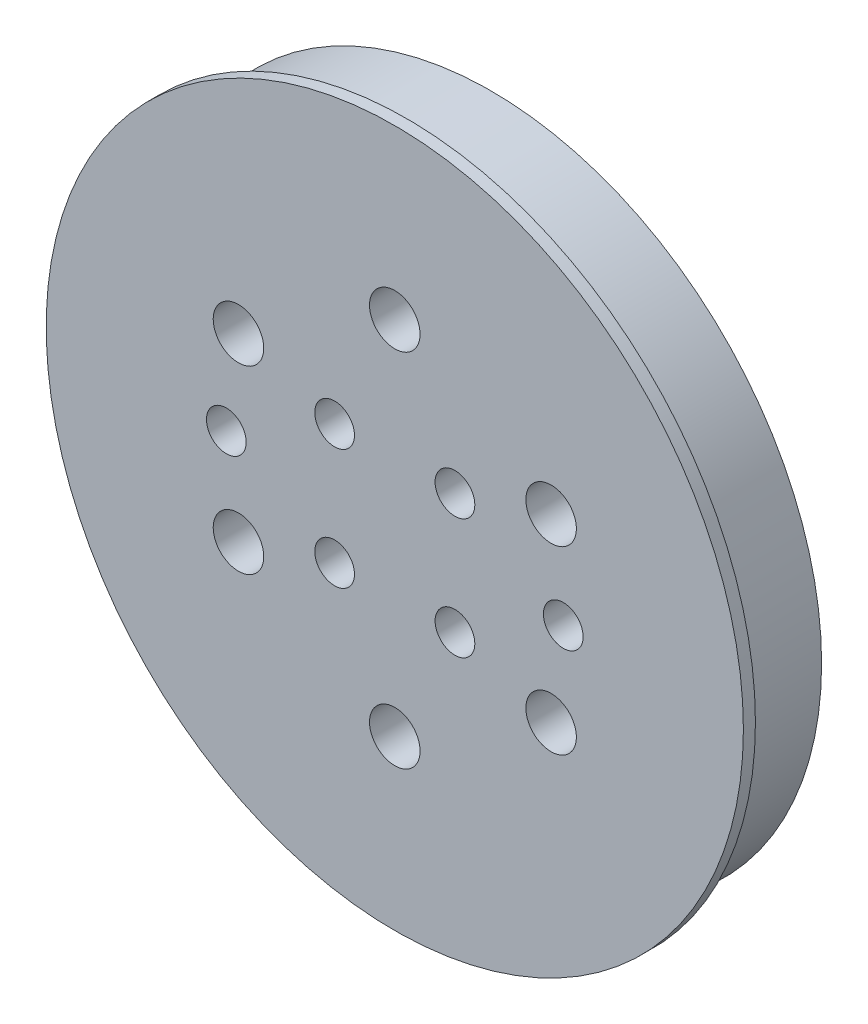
ISO-10303-21;
HEADER;
FILE_DESCRIPTION(('STEP AP214'),'2;1');
FILE_NAME('part.step','',(''),(''),'','','');
FILE_SCHEMA(('AUTOMOTIVE_DESIGN { 1 0 10303 214 1 1 1 1 }'));
ENDSEC;
DATA;
#1=APPLICATION_CONTEXT('core data for automotive mechanical design processes');
#2=APPLICATION_PROTOCOL_DEFINITION('international standard','automotive_design',2000,#1);
#3=PRODUCT_CONTEXT('',#1,'mechanical');
#4=PRODUCT('Part','Part','',(#3));
#5=PRODUCT_RELATED_PRODUCT_CATEGORY('part','',(#4));
#6=PRODUCT_DEFINITION_FORMATION('','',#4);
#7=PRODUCT_DEFINITION_CONTEXT('part definition',#1,'design');
#8=PRODUCT_DEFINITION('design','',#6,#7);
#9=PRODUCT_DEFINITION_SHAPE('','',#8);
#10=(LENGTH_UNIT() NAMED_UNIT(*) SI_UNIT(.MILLI.,.METRE.));
#11=(NAMED_UNIT(*) PLANE_ANGLE_UNIT() SI_UNIT($,.RADIAN.));
#12=(NAMED_UNIT(*) SI_UNIT($,.STERADIAN.) SOLID_ANGLE_UNIT());
#13=UNCERTAINTY_MEASURE_WITH_UNIT(LENGTH_MEASURE(1.E-05),#10,'distance_accuracy_value','');
#14=(GEOMETRIC_REPRESENTATION_CONTEXT(3) GLOBAL_UNCERTAINTY_ASSIGNED_CONTEXT((#13)) GLOBAL_UNIT_ASSIGNED_CONTEXT((#10,
#11,#12)) REPRESENTATION_CONTEXT('',''));
#15=CARTESIAN_POINT('',(0.,0.,0.));
#16=DIRECTION('',(0.,0.,1.));
#17=DIRECTION('',(1.,0.,0.));
#18=AXIS2_PLACEMENT_3D('',#15,#16,#17);
#19=CARTESIAN_POINT('',(-27.9424446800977,11.6577081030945,-3.));
#20=DIRECTION('',(0.,0.,-1.));
#21=DIRECTION('',(0.,-1.,0.));
#22=AXIS2_PLACEMENT_3D('',#19,#20,#21);
#23=PLANE('',#22);
#24=CARTESIAN_POINT('',(-14.9520636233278,4.15770810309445,-3.));
#25=DIRECTION('',(0.,0.,-1.));
#26=DIRECTION('',(-1.,0.,0.));
#27=AXIS2_PLACEMENT_3D('',#24,#25,#26);
#28=CIRCLE('',#27,3.5);
#29=CARTESIAN_POINT('',(-18.4520636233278,4.15770810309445,-3.));
#30=VERTEX_POINT('',#29);
#31=EDGE_CURVE('E42',#30,#30,#28,.T.);
#32=ORIENTED_EDGE('',*,*,#31,.F.);
#33=EDGE_LOOP('',(#32));
#34=FACE_BOUND('',#33,.T.);
#35=CARTESIAN_POINT('',(-22.9424446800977,16.6577081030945,-3.));
#36=DIRECTION('',(0.,0.,-1.));
#37=DIRECTION('',(-1.,0.,0.));
#38=AXIS2_PLACEMENT_3D('',#35,#36,#37);
#39=CIRCLE('',#38,1.65);
#40=CARTESIAN_POINT('',(-24.5924446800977,16.6577081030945,-3.));
#41=VERTEX_POINT('',#40);
#42=EDGE_CURVE('E154',#41,#41,#39,.T.);
#43=ORIENTED_EDGE('',*,*,#42,.F.);
#44=EDGE_LOOP('',(#43));
#45=FACE_BOUND('',#44,.T.);
#46=CARTESIAN_POINT('',(-22.9424446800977,6.65770810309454,-3.));
#47=DIRECTION('',(0.,0.,-1.));
#48=DIRECTION('',(-1.,0.,0.));
#49=AXIS2_PLACEMENT_3D('',#46,#47,#48);
#50=CIRCLE('',#49,1.65);
#51=CARTESIAN_POINT('',(-24.5924446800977,6.65770810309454,-3.));
#52=VERTEX_POINT('',#51);
#53=EDGE_CURVE('E148',#52,#52,#50,.T.);
#54=ORIENTED_EDGE('',*,*,#53,.F.);
#55=EDGE_LOOP('',(#54));
#56=FACE_BOUND('',#55,.T.);
#57=CARTESIAN_POINT('',(-32.9424446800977,16.6577081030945,-3.));
#58=DIRECTION('',(0.,0.,-1.));
#59=DIRECTION('',(-1.,0.,0.));
#60=AXIS2_PLACEMENT_3D('',#57,#58,#59);
#61=CIRCLE('',#60,1.65);
#62=CARTESIAN_POINT('',(-34.5924446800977,16.6577081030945,-3.));
#63=VERTEX_POINT('',#62);
#64=EDGE_CURVE('E128',#63,#63,#61,.T.);
#65=ORIENTED_EDGE('',*,*,#64,.F.);
#66=EDGE_LOOP('',(#65));
#67=FACE_BOUND('',#66,.T.);
#68=CARTESIAN_POINT('',(-40.9328257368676,19.1577081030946,-3.));
#69=DIRECTION('',(0.,0.,-1.));
#70=DIRECTION('',(-1.,0.,0.));
#71=AXIS2_PLACEMENT_3D('',#68,#69,#70);
#72=CIRCLE('',#71,3.5);
#73=CARTESIAN_POINT('',(-44.4328257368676,19.1577081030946,-3.));
#74=VERTEX_POINT('',#73);
#75=EDGE_CURVE('E114',#74,#74,#72,.T.);
#76=ORIENTED_EDGE('',*,*,#75,.F.);
#77=EDGE_LOOP('',(#76));
#78=FACE_BOUND('',#77,.T.);
#79=CARTESIAN_POINT('',(-27.9424446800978,-3.34229189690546,-3.));
#80=DIRECTION('',(0.,0.,-1.));
#81=DIRECTION('',(-1.,0.,0.));
#82=AXIS2_PLACEMENT_3D('',#79,#80,#81);
#83=CIRCLE('',#82,3.5);
#84=CARTESIAN_POINT('',(-31.4424446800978,-3.34229189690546,-3.));
#85=VERTEX_POINT('',#84);
#86=EDGE_CURVE('E101',#85,#85,#83,.T.);
#87=ORIENTED_EDGE('',*,*,#86,.F.);
#88=EDGE_LOOP('',(#87));
#89=FACE_BOUND('',#88,.T.);
#90=CARTESIAN_POINT('',(-40.9328257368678,4.15770810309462,-3.));
#91=DIRECTION('',(0.,0.,-1.));
#92=DIRECTION('',(-1.,0.,0.));
#93=AXIS2_PLACEMENT_3D('',#90,#91,#92);
#94=CIRCLE('',#93,3.5);
#95=CARTESIAN_POINT('',(-44.4328257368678,4.15770810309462,-3.));
#96=VERTEX_POINT('',#95);
#97=EDGE_CURVE('E102',#96,#96,#94,.T.);
#98=ORIENTED_EDGE('',*,*,#97,.F.);
#99=EDGE_LOOP('',(#98));
#100=FACE_BOUND('',#99,.T.);
#101=CARTESIAN_POINT('',(-14.9520636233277,19.1577081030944,-3.));
#102=DIRECTION('',(0.,0.,-1.));
#103=DIRECTION('',(-1.,0.,0.));
#104=AXIS2_PLACEMENT_3D('',#101,#102,#103);
#105=CIRCLE('',#104,3.5);
#106=CARTESIAN_POINT('',(-18.4520636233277,19.1577081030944,-3.));
#107=VERTEX_POINT('',#106);
#108=EDGE_CURVE('E50',#107,#107,#105,.T.);
#109=ORIENTED_EDGE('',*,*,#108,.F.);
#110=EDGE_LOOP('',(#109));
#111=FACE_BOUND('',#110,.T.);
#112=CARTESIAN_POINT('',(-27.9424446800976,26.6577081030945,-3.));
#113=DIRECTION('',(0.,0.,-1.));
#114=DIRECTION('',(-1.,0.,0.));
#115=AXIS2_PLACEMENT_3D('',#112,#113,#114);
#116=CIRCLE('',#115,3.5);
#117=CARTESIAN_POINT('',(-31.4424446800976,26.6577081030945,-3.));
#118=VERTEX_POINT('',#117);
#119=EDGE_CURVE('E59',#118,#118,#116,.T.);
#120=ORIENTED_EDGE('',*,*,#119,.F.);
#121=EDGE_LOOP('',(#120));
#122=FACE_BOUND('',#121,.T.);
#123=CARTESIAN_POINT('',(-32.9424446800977,6.65770810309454,-3.));
#124=DIRECTION('',(0.,0.,-1.));
#125=DIRECTION('',(-1.,0.,0.));
#126=AXIS2_PLACEMENT_3D('',#123,#124,#125);
#127=CIRCLE('',#126,1.65);
#128=CARTESIAN_POINT('',(-34.5924446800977,6.65770810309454,-3.));
#129=VERTEX_POINT('',#128);
#130=EDGE_CURVE('E139',#129,#129,#127,.T.);
#131=ORIENTED_EDGE('',*,*,#130,.F.);
#132=EDGE_LOOP('',(#131));
#133=FACE_BOUND('',#132,.T.);
#134=CARTESIAN_POINT('',(-41.9424446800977,11.6577081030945,-3.));
#135=DIRECTION('',(0.,0.,-1.));
#136=DIRECTION('',(-1.,0.,0.));
#137=AXIS2_PLACEMENT_3D('',#134,#135,#136);
#138=CIRCLE('',#137,1.65);
#139=CARTESIAN_POINT('',(-43.5924446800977,11.6577081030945,-3.));
#140=VERTEX_POINT('',#139);
#141=EDGE_CURVE('E149',#140,#140,#138,.T.);
#142=ORIENTED_EDGE('',*,*,#141,.F.);
#143=EDGE_LOOP('',(#142));
#144=FACE_BOUND('',#143,.T.);
#145=CARTESIAN_POINT('',(-13.9424446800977,11.6577081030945,-3.));
#146=DIRECTION('',(0.,0.,-1.));
#147=DIRECTION('',(-1.,0.,0.));
#148=AXIS2_PLACEMENT_3D('',#145,#146,#147);
#149=CIRCLE('',#148,1.65);
#150=CARTESIAN_POINT('',(-15.5924446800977,11.6577081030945,-3.));
#151=VERTEX_POINT('',#150);
#152=EDGE_CURVE('E10',#151,#151,#149,.T.);
#153=ORIENTED_EDGE('',*,*,#152,.F.);
#154=EDGE_LOOP('',(#153));
#155=FACE_BOUND('',#154,.T.);
#156=CARTESIAN_POINT('',(-27.9424446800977,11.6577081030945,-3.));
#157=DIRECTION('',(0.,0.,-1.));
#158=DIRECTION('',(-1.,0.,0.));
#159=AXIS2_PLACEMENT_3D('',#156,#157,#158);
#160=CIRCLE('',#159,21.);
#161=CARTESIAN_POINT('',(-48.9424446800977,11.6577081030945,-3.));
#162=VERTEX_POINT('',#161);
#163=EDGE_CURVE('E244',#162,#162,#160,.T.);
#164=ORIENTED_EDGE('',*,*,#163,.T.);
#165=EDGE_LOOP('',(#164));
#166=FACE_BOUND('',#165,.T.);
#167=ADVANCED_FACE('F15',(#34,#45,#56,#67,#78,#89,#100,#111,#122,#133,#144,#155,#166),#23,.T.);
#168=CARTESIAN_POINT('',(-27.9424446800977,36.1577081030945,4.));
#169=DIRECTION('',(0.,0.,-1.));
#170=DIRECTION('',(0.,-1.,0.));
#171=AXIS2_PLACEMENT_3D('',#168,#169,#170);
#172=PLANE('',#171);
#173=CARTESIAN_POINT('',(-27.9424446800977,36.1577081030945,4.));
#174=DIRECTION('',(0.,0.,-1.));
#175=DIRECTION('',(-1.,0.,0.));
#176=AXIS2_PLACEMENT_3D('',#173,#174,#175);
#177=CIRCLE('',#176,1.25);
#178=CARTESIAN_POINT('',(-29.1924446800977,36.1577081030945,4.));
#179=VERTEX_POINT('',#178);
#180=EDGE_CURVE('E221',#179,#179,#177,.T.);
#181=ORIENTED_EDGE('',*,*,#180,.T.);
#182=EDGE_LOOP('',(#181));
#183=FACE_BOUND('',#182,.T.);
#184=ADVANCED_FACE('F297',(#183),#172,.T.);
#185=CARTESIAN_POINT('',(-45.2665608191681,28.9818242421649,4.));
#186=DIRECTION('',(0.,0.,-1.));
#187=DIRECTION('',(0.,-1.,0.));
#188=AXIS2_PLACEMENT_3D('',#185,#186,#187);
#189=PLANE('',#188);
#190=CARTESIAN_POINT('',(-45.2665608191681,28.9818242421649,4.));
#191=DIRECTION('',(0.,0.,-1.));
#192=DIRECTION('',(-1.,0.,0.));
#193=AXIS2_PLACEMENT_3D('',#190,#191,#192);
#194=CIRCLE('',#193,1.25);
#195=CARTESIAN_POINT('',(-46.5165608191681,28.9818242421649,4.));
#196=VERTEX_POINT('',#195);
#197=EDGE_CURVE('E216',#196,#196,#194,.T.);
#198=ORIENTED_EDGE('',*,*,#197,.T.);
#199=EDGE_LOOP('',(#198));
#200=FACE_BOUND('',#199,.T.);
#201=ADVANCED_FACE('F302',(#200),#189,.T.);
#202=CARTESIAN_POINT('',(-52.4424446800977,11.6577081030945,4.));
#203=DIRECTION('',(0.,0.,-1.));
#204=DIRECTION('',(0.,-1.,0.));
#205=AXIS2_PLACEMENT_3D('',#202,#203,#204);
#206=PLANE('',#205);
#207=CARTESIAN_POINT('',(-52.4424446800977,11.6577081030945,4.));
#208=DIRECTION('',(0.,0.,-1.));
#209=DIRECTION('',(-1.,0.,0.));
#210=AXIS2_PLACEMENT_3D('',#207,#208,#209);
#211=CIRCLE('',#210,1.25);
#212=CARTESIAN_POINT('',(-53.6924446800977,11.6577081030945,4.));
#213=VERTEX_POINT('',#212);
#214=EDGE_CURVE('E215',#213,#213,#211,.T.);
#215=ORIENTED_EDGE('',*,*,#214,.T.);
#216=EDGE_LOOP('',(#215));
#217=FACE_BOUND('',#216,.T.);
#218=ADVANCED_FACE('F361',(#217),#206,.T.);
#219=CARTESIAN_POINT('',(-45.2665608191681,-5.66640803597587,4.));
#220=DIRECTION('',(0.,0.,-1.));
#221=DIRECTION('',(0.,-1.,0.));
#222=AXIS2_PLACEMENT_3D('',#219,#220,#221);
#223=PLANE('',#222);
#224=CARTESIAN_POINT('',(-45.2665608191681,-5.66640803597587,4.));
#225=DIRECTION('',(0.,0.,-1.));
#226=DIRECTION('',(-1.,0.,0.));
#227=AXIS2_PLACEMENT_3D('',#224,#225,#226);
#228=CIRCLE('',#227,1.25);
#229=CARTESIAN_POINT('',(-46.5165608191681,-5.66640803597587,4.));
#230=VERTEX_POINT('',#229);
#231=EDGE_CURVE('E206',#230,#230,#228,.T.);
#232=ORIENTED_EDGE('',*,*,#231,.T.);
#233=EDGE_LOOP('',(#232));
#234=FACE_BOUND('',#233,.T.);
#235=ADVANCED_FACE('F364',(#234),#223,.T.);
#236=CARTESIAN_POINT('',(-27.9424446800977,-12.8422918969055,4.));
#237=DIRECTION('',(0.,0.,-1.));
#238=DIRECTION('',(0.,-1.,0.));
#239=AXIS2_PLACEMENT_3D('',#236,#237,#238);
#240=PLANE('',#239);
#241=CARTESIAN_POINT('',(-27.9424446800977,-12.8422918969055,4.));
#242=DIRECTION('',(0.,0.,-1.));
#243=DIRECTION('',(-1.,0.,0.));
#244=AXIS2_PLACEMENT_3D('',#241,#242,#243);
#245=CIRCLE('',#244,1.25);
#246=CARTESIAN_POINT('',(-29.1924446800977,-12.8422918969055,4.));
#247=VERTEX_POINT('',#246);
#248=EDGE_CURVE('E194',#247,#247,#245,.T.);
#249=ORIENTED_EDGE('',*,*,#248,.T.);
#250=EDGE_LOOP('',(#249));
#251=FACE_BOUND('',#250,.T.);
#252=ADVANCED_FACE('F475',(#251),#240,.T.);
#253=CARTESIAN_POINT('',(-10.6183285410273,-5.66640803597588,4.));
#254=DIRECTION('',(0.,0.,-1.));
#255=DIRECTION('',(0.,-1.,0.));
#256=AXIS2_PLACEMENT_3D('',#253,#254,#255);
#257=PLANE('',#256);
#258=CARTESIAN_POINT('',(-10.6183285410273,-5.66640803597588,4.));
#259=DIRECTION('',(0.,0.,-1.));
#260=DIRECTION('',(-1.,0.,0.));
#261=AXIS2_PLACEMENT_3D('',#258,#259,#260);
#262=CIRCLE('',#261,1.25);
#263=CARTESIAN_POINT('',(-11.8683285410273,-5.66640803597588,4.));
#264=VERTEX_POINT('',#263);
#265=EDGE_CURVE('E183',#264,#264,#262,.T.);
#266=ORIENTED_EDGE('',*,*,#265,.T.);
#267=EDGE_LOOP('',(#266));
#268=FACE_BOUND('',#267,.T.);
#269=ADVANCED_FACE('F477',(#268),#257,.T.);
#270=CARTESIAN_POINT('',(-3.44244468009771,11.6577081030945,4.));
#271=DIRECTION('',(0.,0.,-1.));
#272=DIRECTION('',(0.,-1.,0.));
#273=AXIS2_PLACEMENT_3D('',#270,#271,#272);
#274=PLANE('',#273);
#275=CARTESIAN_POINT('',(-3.44244468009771,11.6577081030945,4.));
#276=DIRECTION('',(0.,0.,-1.));
#277=DIRECTION('',(-1.,0.,0.));
#278=AXIS2_PLACEMENT_3D('',#275,#276,#277);
#279=CIRCLE('',#278,1.25);
#280=CARTESIAN_POINT('',(-4.69244468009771,11.6577081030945,4.));
#281=VERTEX_POINT('',#280);
#282=EDGE_CURVE('E178',#281,#281,#279,.T.);
#283=ORIENTED_EDGE('',*,*,#282,.T.);
#284=EDGE_LOOP('',(#283));
#285=FACE_BOUND('',#284,.T.);
#286=ADVANCED_FACE('F292',(#285),#274,.T.);
#287=CARTESIAN_POINT('',(-10.6183285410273,28.9818242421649,4.));
#288=DIRECTION('',(0.,0.,-1.));
#289=DIRECTION('',(0.,-1.,0.));
#290=AXIS2_PLACEMENT_3D('',#287,#288,#289);
#291=PLANE('',#290);
#292=CARTESIAN_POINT('',(-10.6183285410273,28.9818242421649,4.));
#293=DIRECTION('',(0.,0.,-1.));
#294=DIRECTION('',(-1.,0.,0.));
#295=AXIS2_PLACEMENT_3D('',#292,#293,#294);
#296=CIRCLE('',#295,1.25);
#297=CARTESIAN_POINT('',(-11.8683285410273,28.9818242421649,4.));
#298=VERTEX_POINT('',#297);
#299=EDGE_CURVE('E169',#298,#298,#296,.T.);
#300=ORIENTED_EDGE('',*,*,#299,.T.);
#301=EDGE_LOOP('',(#300));
#302=FACE_BOUND('',#301,.T.);
#303=ADVANCED_FACE('F282',(#302),#291,.T.);
#304=CARTESIAN_POINT('',(-27.9424446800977,11.6577081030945,7.));
#305=DIRECTION('',(0.,0.,1.));
#306=DIRECTION('',(1.,0.,0.));
#307=AXIS2_PLACEMENT_3D('',#304,#305,#306);
#308=PLANE('',#307);
#309=CARTESIAN_POINT('',(-27.9424446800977,11.6577081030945,7.));
#310=DIRECTION('',(0.,0.,1.));
#311=DIRECTION('',(1.,0.,0.));
#312=AXIS2_PLACEMENT_3D('',#309,#310,#311);
#313=CIRCLE('',#312,27.47);
#314=CARTESIAN_POINT('',(-0.472444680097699,11.6577081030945,7.));
#315=VERTEX_POINT('',#314);
#316=EDGE_CURVE('E31',#315,#315,#313,.T.);
#317=ORIENTED_EDGE('',*,*,#316,.T.);
#318=EDGE_LOOP('',(#317));
#319=FACE_BOUND('',#318,.T.);
#320=CARTESIAN_POINT('',(-27.9424446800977,11.6577081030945,7.));
#321=DIRECTION('',(0.,0.,1.));
#322=DIRECTION('',(1.,0.,0.));
#323=AXIS2_PLACEMENT_3D('',#320,#321,#322);
#324=CIRCLE('',#323,28.97);
#325=CARTESIAN_POINT('',(1.0275553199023,11.6577081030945,7.));
#326=VERTEX_POINT('',#325);
#327=EDGE_CURVE('E202',#326,#326,#324,.T.);
#328=ORIENTED_EDGE('',*,*,#327,.F.);
#329=EDGE_LOOP('',(#328));
#330=FACE_BOUND('',#329,.T.);
#331=ADVANCED_FACE('F279',(#319,#330),#308,.F.);
#332=CARTESIAN_POINT('',(-40.9328257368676,19.1577081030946,2.));
#333=DIRECTION('',(0.,0.,-1.));
#334=DIRECTION('',(0.,-1.,0.));
#335=AXIS2_PLACEMENT_3D('',#332,#333,#334);
#336=PLANE('',#335);
#337=CARTESIAN_POINT('',(-40.9328257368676,19.1577081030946,2.));
#338=DIRECTION('',(0.,0.,1.));
#339=DIRECTION('',(-1.,0.,0.));
#340=AXIS2_PLACEMENT_3D('',#337,#338,#339);
#341=CIRCLE('',#340,2.1);
#342=CARTESIAN_POINT('',(-43.0328257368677,19.1577081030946,2.));
#343=VERTEX_POINT('',#342);
#344=EDGE_CURVE('E82',#343,#343,#341,.T.);
#345=ORIENTED_EDGE('',*,*,#344,.T.);
#346=EDGE_LOOP('',(#345));
#347=FACE_BOUND('',#346,.T.);
#348=CARTESIAN_POINT('',(-40.9328257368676,19.1577081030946,2.));
#349=DIRECTION('',(0.,0.,-1.));
#350=DIRECTION('',(-1.,0.,0.));
#351=AXIS2_PLACEMENT_3D('',#348,#349,#350);
#352=CIRCLE('',#351,3.5);
#353=CARTESIAN_POINT('',(-44.4328257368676,19.1577081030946,2.));
#354=VERTEX_POINT('',#353);
#355=EDGE_CURVE('E118',#354,#354,#352,.T.);
#356=ORIENTED_EDGE('',*,*,#355,.T.);
#357=EDGE_LOOP('',(#356));
#358=FACE_BOUND('',#357,.T.);
#359=ADVANCED_FACE('F281',(#347,#358),#336,.T.);
#360=CARTESIAN_POINT('',(-40.9328257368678,4.15770810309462,2.));
#361=DIRECTION('',(0.,0.,-1.));
#362=DIRECTION('',(0.,-1.,0.));
#363=AXIS2_PLACEMENT_3D('',#360,#361,#362);
#364=PLANE('',#363);
#365=CARTESIAN_POINT('',(-40.9328257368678,4.15770810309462,2.));
#366=DIRECTION('',(0.,0.,1.));
#367=DIRECTION('',(-1.,0.,0.));
#368=AXIS2_PLACEMENT_3D('',#365,#366,#367);
#369=CIRCLE('',#368,2.1);
#370=CARTESIAN_POINT('',(-43.0328257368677,4.15770810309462,2.));
#371=VERTEX_POINT('',#370);
#372=EDGE_CURVE('E83',#371,#371,#369,.T.);
#373=ORIENTED_EDGE('',*,*,#372,.T.);
#374=EDGE_LOOP('',(#373));
#375=FACE_BOUND('',#374,.T.);
#376=CARTESIAN_POINT('',(-40.9328257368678,4.15770810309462,2.));
#377=DIRECTION('',(0.,0.,-1.));
#378=DIRECTION('',(-1.,0.,0.));
#379=AXIS2_PLACEMENT_3D('',#376,#377,#378);
#380=CIRCLE('',#379,3.5);
#381=CARTESIAN_POINT('',(-44.4328257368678,4.15770810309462,2.));
#382=VERTEX_POINT('',#381);
#383=EDGE_CURVE('E110',#382,#382,#380,.T.);
#384=ORIENTED_EDGE('',*,*,#383,.T.);
#385=EDGE_LOOP('',(#384));
#386=FACE_BOUND('',#385,.T.);
#387=ADVANCED_FACE('F290',(#375,#386),#364,.T.);
#388=CARTESIAN_POINT('',(-27.9424446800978,-3.34229189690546,2.));
#389=DIRECTION('',(0.,0.,-1.));
#390=DIRECTION('',(0.,-1.,0.));
#391=AXIS2_PLACEMENT_3D('',#388,#389,#390);
#392=PLANE('',#391);
#393=CARTESIAN_POINT('',(-27.9424446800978,-3.34229189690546,2.));
#394=DIRECTION('',(0.,0.,1.));
#395=DIRECTION('',(-1.,0.,0.));
#396=AXIS2_PLACEMENT_3D('',#393,#394,#395);
#397=CIRCLE('',#396,2.1);
#398=CARTESIAN_POINT('',(-30.0424446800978,-3.34229189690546,2.));
#399=VERTEX_POINT('',#398);
#400=EDGE_CURVE('E73',#399,#399,#397,.T.);
#401=ORIENTED_EDGE('',*,*,#400,.T.);
#402=EDGE_LOOP('',(#401));
#403=FACE_BOUND('',#402,.T.);
#404=CARTESIAN_POINT('',(-27.9424446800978,-3.34229189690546,2.));
#405=DIRECTION('',(0.,0.,-1.));
#406=DIRECTION('',(-1.,0.,0.));
#407=AXIS2_PLACEMENT_3D('',#404,#405,#406);
#408=CIRCLE('',#407,3.5);
#409=CARTESIAN_POINT('',(-31.4424446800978,-3.34229189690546,2.));
#410=VERTEX_POINT('',#409);
#411=EDGE_CURVE('E97',#410,#410,#408,.T.);
#412=ORIENTED_EDGE('',*,*,#411,.T.);
#413=EDGE_LOOP('',(#412));
#414=FACE_BOUND('',#413,.T.);
#415=ADVANCED_FACE('F429',(#403,#414),#392,.T.);
#416=CARTESIAN_POINT('',(-14.9520636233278,4.15770810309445,2.));
#417=DIRECTION('',(0.,0.,-1.));
#418=DIRECTION('',(0.,-1.,0.));
#419=AXIS2_PLACEMENT_3D('',#416,#417,#418);
#420=PLANE('',#419);
#421=CARTESIAN_POINT('',(-14.9520636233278,4.15770810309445,2.));
#422=DIRECTION('',(0.,0.,1.));
#423=DIRECTION('',(-1.,0.,0.));
#424=AXIS2_PLACEMENT_3D('',#421,#422,#423);
#425=CIRCLE('',#424,2.1);
#426=CARTESIAN_POINT('',(-17.0520636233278,4.15770810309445,2.));
#427=VERTEX_POINT('',#426);
#428=EDGE_CURVE('E68',#427,#427,#425,.T.);
#429=ORIENTED_EDGE('',*,*,#428,.T.);
#430=EDGE_LOOP('',(#429));
#431=FACE_BOUND('',#430,.T.);
#432=CARTESIAN_POINT('',(-14.9520636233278,4.15770810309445,2.));
#433=DIRECTION('',(0.,0.,-1.));
#434=DIRECTION('',(-1.,0.,0.));
#435=AXIS2_PLACEMENT_3D('',#432,#433,#434);
#436=CIRCLE('',#435,3.5);
#437=CARTESIAN_POINT('',(-18.4520636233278,4.15770810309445,2.));
#438=VERTEX_POINT('',#437);
#439=EDGE_CURVE('E103',#438,#438,#436,.T.);
#440=ORIENTED_EDGE('',*,*,#439,.T.);
#441=EDGE_LOOP('',(#440));
#442=FACE_BOUND('',#441,.T.);
#443=ADVANCED_FACE('F467',(#431,#442),#420,.T.);
#444=CARTESIAN_POINT('',(-14.9520636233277,19.1577081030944,2.));
#445=DIRECTION('',(0.,0.,-1.));
#446=DIRECTION('',(0.,-1.,0.));
#447=AXIS2_PLACEMENT_3D('',#444,#445,#446);
#448=PLANE('',#447);
#449=CARTESIAN_POINT('',(-14.9520636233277,19.1577081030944,2.));
#450=DIRECTION('',(0.,0.,1.));
#451=DIRECTION('',(-1.,0.,0.));
#452=AXIS2_PLACEMENT_3D('',#449,#450,#451);
#453=CIRCLE('',#452,2.1);
#454=CARTESIAN_POINT('',(-17.0520636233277,19.1577081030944,2.));
#455=VERTEX_POINT('',#454);
#456=EDGE_CURVE('E44',#455,#455,#453,.T.);
#457=ORIENTED_EDGE('',*,*,#456,.T.);
#458=EDGE_LOOP('',(#457));
#459=FACE_BOUND('',#458,.T.);
#460=CARTESIAN_POINT('',(-14.9520636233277,19.1577081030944,2.));
#461=DIRECTION('',(0.,0.,-1.));
#462=DIRECTION('',(-1.,0.,0.));
#463=AXIS2_PLACEMENT_3D('',#460,#461,#462);
#464=CIRCLE('',#463,3.5);
#465=CARTESIAN_POINT('',(-18.4520636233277,19.1577081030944,2.));
#466=VERTEX_POINT('',#465);
#467=EDGE_CURVE('E55',#466,#466,#464,.T.);
#468=ORIENTED_EDGE('',*,*,#467,.T.);
#469=EDGE_LOOP('',(#468));
#470=FACE_BOUND('',#469,.T.);
#471=ADVANCED_FACE('F396',(#459,#470),#448,.T.);
#472=CARTESIAN_POINT('',(-27.9424446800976,26.6577081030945,2.));
#473=DIRECTION('',(0.,0.,-1.));
#474=DIRECTION('',(0.,-1.,0.));
#475=AXIS2_PLACEMENT_3D('',#472,#473,#474);
#476=PLANE('',#475);
#477=CARTESIAN_POINT('',(-27.9424446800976,26.6577081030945,2.));
#478=DIRECTION('',(0.,0.,1.));
#479=DIRECTION('',(-1.,0.,0.));
#480=AXIS2_PLACEMENT_3D('',#477,#478,#479);
#481=CIRCLE('',#480,2.1);
#482=CARTESIAN_POINT('',(-30.0424446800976,26.6577081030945,2.));
#483=VERTEX_POINT('',#482);
#484=EDGE_CURVE('E67',#483,#483,#481,.T.);
#485=ORIENTED_EDGE('',*,*,#484,.T.);
#486=EDGE_LOOP('',(#485));
#487=FACE_BOUND('',#486,.T.);
#488=CARTESIAN_POINT('',(-27.9424446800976,26.6577081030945,2.));
#489=DIRECTION('',(0.,0.,-1.));
#490=DIRECTION('',(-1.,0.,0.));
#491=AXIS2_PLACEMENT_3D('',#488,#489,#490);
#492=CIRCLE('',#491,3.5);
#493=CARTESIAN_POINT('',(-31.4424446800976,26.6577081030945,2.));
#494=VERTEX_POINT('',#493);
#495=EDGE_CURVE('E54',#494,#494,#492,.T.);
#496=ORIENTED_EDGE('',*,*,#495,.T.);
#497=EDGE_LOOP('',(#496));
#498=FACE_BOUND('',#497,.T.);
#499=ADVANCED_FACE('F394',(#487,#498),#476,.T.);
#500=CARTESIAN_POINT('',(0.,0.,8.));
#501=DIRECTION('',(0.,0.,1.));
#502=DIRECTION('',(1.,0.,0.));
#503=AXIS2_PLACEMENT_3D('',#500,#501,#502);
#504=PLANE('',#503);
#505=CARTESIAN_POINT('',(-13.9424446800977,11.6577081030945,8.));
#506=DIRECTION('',(0.,0.,-1.));
#507=DIRECTION('',(1.,0.,0.));
#508=AXIS2_PLACEMENT_3D('',#505,#506,#507);
#509=CIRCLE('',#508,1.65);
#510=CARTESIAN_POINT('',(-12.2924446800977,11.6577081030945,8.));
#511=VERTEX_POINT('',#510);
#512=EDGE_CURVE('E22',#511,#511,#509,.T.);
#513=ORIENTED_EDGE('',*,*,#512,.T.);
#514=EDGE_LOOP('',(#513));
#515=FACE_BOUND('',#514,.T.);
#516=CARTESIAN_POINT('',(-27.9424446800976,26.6577081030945,8.));
#517=DIRECTION('',(0.,0.,1.));
#518=DIRECTION('',(1.,0.,0.));
#519=AXIS2_PLACEMENT_3D('',#516,#517,#518);
#520=CIRCLE('',#519,2.1);
#521=CARTESIAN_POINT('',(-25.8424446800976,26.6577081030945,8.));
#522=VERTEX_POINT('',#521);
#523=EDGE_CURVE('E63',#522,#522,#520,.T.);
#524=ORIENTED_EDGE('',*,*,#523,.F.);
#525=EDGE_LOOP('',(#524));
#526=FACE_BOUND('',#525,.T.);
#527=CARTESIAN_POINT('',(-14.9520636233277,19.1577081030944,8.));
#528=DIRECTION('',(0.,0.,1.));
#529=DIRECTION('',(1.,0.,0.));
#530=AXIS2_PLACEMENT_3D('',#527,#528,#529);
#531=CIRCLE('',#530,2.1);
#532=CARTESIAN_POINT('',(-12.8520636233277,19.1577081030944,8.));
#533=VERTEX_POINT('',#532);
#534=EDGE_CURVE('E49',#533,#533,#531,.T.);
#535=ORIENTED_EDGE('',*,*,#534,.F.);
#536=EDGE_LOOP('',(#535));
#537=FACE_BOUND('',#536,.T.);
#538=CARTESIAN_POINT('',(-14.9520636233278,4.15770810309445,8.));
#539=DIRECTION('',(0.,0.,1.));
#540=DIRECTION('',(1.,0.,0.));
#541=AXIS2_PLACEMENT_3D('',#538,#539,#540);
#542=CIRCLE('',#541,2.1);
#543=CARTESIAN_POINT('',(-12.8520636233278,4.15770810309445,8.));
#544=VERTEX_POINT('',#543);
#545=EDGE_CURVE('E48',#544,#544,#542,.T.);
#546=ORIENTED_EDGE('',*,*,#545,.F.);
#547=EDGE_LOOP('',(#546));
#548=FACE_BOUND('',#547,.T.);
#549=CARTESIAN_POINT('',(-27.9424446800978,-3.34229189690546,8.));
#550=DIRECTION('',(0.,0.,1.));
#551=DIRECTION('',(1.,0.,0.));
#552=AXIS2_PLACEMENT_3D('',#549,#550,#551);
#553=CIRCLE('',#552,2.1);
#554=CARTESIAN_POINT('',(-25.8424446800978,-3.34229189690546,8.));
#555=VERTEX_POINT('',#554);
#556=EDGE_CURVE('E72',#555,#555,#553,.T.);
#557=ORIENTED_EDGE('',*,*,#556,.F.);
#558=EDGE_LOOP('',(#557));
#559=FACE_BOUND('',#558,.T.);
#560=CARTESIAN_POINT('',(-40.9328257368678,4.15770810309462,8.));
#561=DIRECTION('',(0.,0.,1.));
#562=DIRECTION('',(1.,0.,0.));
#563=AXIS2_PLACEMENT_3D('',#560,#561,#562);
#564=CIRCLE('',#563,2.1);
#565=CARTESIAN_POINT('',(-38.8328257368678,4.15770810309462,8.));
#566=VERTEX_POINT('',#565);
#567=EDGE_CURVE('E77',#566,#566,#564,.T.);
#568=ORIENTED_EDGE('',*,*,#567,.F.);
#569=EDGE_LOOP('',(#568));
#570=FACE_BOUND('',#569,.T.);
#571=CARTESIAN_POINT('',(-40.9328257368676,19.1577081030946,8.));
#572=DIRECTION('',(0.,0.,1.));
#573=DIRECTION('',(1.,0.,0.));
#574=AXIS2_PLACEMENT_3D('',#571,#572,#573);
#575=CIRCLE('',#574,2.1);
#576=CARTESIAN_POINT('',(-38.8328257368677,19.1577081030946,8.));
#577=VERTEX_POINT('',#576);
#578=EDGE_CURVE('E78',#577,#577,#575,.T.);
#579=ORIENTED_EDGE('',*,*,#578,.F.);
#580=EDGE_LOOP('',(#579));
#581=FACE_BOUND('',#580,.T.);
#582=CARTESIAN_POINT('',(-32.9424446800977,16.6577081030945,8.));
#583=DIRECTION('',(0.,0.,1.));
#584=DIRECTION('',(1.,0.,0.));
#585=AXIS2_PLACEMENT_3D('',#582,#583,#584);
#586=CIRCLE('',#585,1.65);
#587=CARTESIAN_POINT('',(-31.2924446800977,16.6577081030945,8.));
#588=VERTEX_POINT('',#587);
#589=EDGE_CURVE('E132',#588,#588,#586,.T.);
#590=ORIENTED_EDGE('',*,*,#589,.F.);
#591=EDGE_LOOP('',(#590));
#592=FACE_BOUND('',#591,.T.);
#593=CARTESIAN_POINT('',(-32.9424446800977,6.65770810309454,8.));
#594=DIRECTION('',(0.,0.,1.));
#595=DIRECTION('',(1.,0.,0.));
#596=AXIS2_PLACEMENT_3D('',#593,#594,#595);
#597=CIRCLE('',#596,1.65);
#598=CARTESIAN_POINT('',(-31.2924446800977,6.65770810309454,8.));
#599=VERTEX_POINT('',#598);
#600=EDGE_CURVE('E143',#599,#599,#597,.T.);
#601=ORIENTED_EDGE('',*,*,#600,.F.);
#602=EDGE_LOOP('',(#601));
#603=FACE_BOUND('',#602,.T.);
#604=CARTESIAN_POINT('',(-22.9424446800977,6.65770810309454,8.));
#605=DIRECTION('',(0.,0.,1.));
#606=DIRECTION('',(1.,0.,0.));
#607=AXIS2_PLACEMENT_3D('',#604,#605,#606);
#608=CIRCLE('',#607,1.65);
#609=CARTESIAN_POINT('',(-21.2924446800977,6.65770810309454,8.));
#610=VERTEX_POINT('',#609);
#611=EDGE_CURVE('E144',#610,#610,#608,.T.);
#612=ORIENTED_EDGE('',*,*,#611,.F.);
#613=EDGE_LOOP('',(#612));
#614=FACE_BOUND('',#613,.T.);
#615=CARTESIAN_POINT('',(-41.9424446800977,11.6577081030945,8.));
#616=DIRECTION('',(0.,0.,1.));
#617=DIRECTION('',(1.,0.,0.));
#618=AXIS2_PLACEMENT_3D('',#615,#616,#617);
#619=CIRCLE('',#618,1.65);
#620=CARTESIAN_POINT('',(-40.2924446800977,11.6577081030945,8.));
#621=VERTEX_POINT('',#620);
#622=EDGE_CURVE('E153',#621,#621,#619,.T.);
#623=ORIENTED_EDGE('',*,*,#622,.F.);
#624=EDGE_LOOP('',(#623));
#625=FACE_BOUND('',#624,.T.);
#626=CARTESIAN_POINT('',(-22.9424446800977,16.6577081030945,8.));
#627=DIRECTION('',(0.,0.,1.));
#628=DIRECTION('',(1.,0.,0.));
#629=AXIS2_PLACEMENT_3D('',#626,#627,#628);
#630=CIRCLE('',#629,1.65);
#631=CARTESIAN_POINT('',(-21.2924446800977,16.6577081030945,8.));
#632=VERTEX_POINT('',#631);
#633=EDGE_CURVE('E158',#632,#632,#630,.T.);
#634=ORIENTED_EDGE('',*,*,#633,.F.);
#635=EDGE_LOOP('',(#634));
#636=FACE_BOUND('',#635,.T.);
#637=CARTESIAN_POINT('',(-27.9424446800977,11.6577081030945,8.));
#638=DIRECTION('',(0.,0.,1.));
#639=DIRECTION('',(1.,0.,0.));
#640=AXIS2_PLACEMENT_3D('',#637,#638,#639);
#641=CIRCLE('',#640,28.97);
#642=CARTESIAN_POINT('',(1.0275553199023,11.6577081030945,8.));
#643=VERTEX_POINT('',#642);
#644=EDGE_CURVE('E165',#643,#643,#641,.T.);
#645=ORIENTED_EDGE('',*,*,#644,.T.);
#646=EDGE_LOOP('',(#645));
#647=FACE_BOUND('',#646,.T.);
#648=ADVANCED_FACE('F269',(#515,#526,#537,#548,#559,#570,#581,#592,#603,#614,#625,#636,#647),
#504,.T.);
#649=CARTESIAN_POINT('',(0.,0.,0.));
#650=DIRECTION('',(0.,0.,1.));
#651=DIRECTION('',(1.,0.,0.));
#652=AXIS2_PLACEMENT_3D('',#649,#650,#651);
#653=PLANE('',#652);
#654=CARTESIAN_POINT('',(-27.9424446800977,11.6577081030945,0.));
#655=DIRECTION('',(0.,0.,-1.));
#656=DIRECTION('',(1.,0.,0.));
#657=AXIS2_PLACEMENT_3D('',#654,#655,#656);
#658=CIRCLE('',#657,21.);
#659=CARTESIAN_POINT('',(-6.9424446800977,11.6577081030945,0.));
#660=VERTEX_POINT('',#659);
#661=EDGE_CURVE('E240',#660,#660,#658,.T.);
#662=ORIENTED_EDGE('',*,*,#661,.F.);
#663=EDGE_LOOP('',(#662));
#664=FACE_BOUND('',#663,.T.);
#665=CARTESIAN_POINT('',(-27.9424446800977,36.1577081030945,0.));
#666=DIRECTION('',(0.,0.,-1.));
#667=DIRECTION('',(-1.,0.,0.));
#668=AXIS2_PLACEMENT_3D('',#665,#666,#667);
#669=CIRCLE('',#668,1.25);
#670=CARTESIAN_POINT('',(-29.1924446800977,36.1577081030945,0.));
#671=VERTEX_POINT('',#670);
#672=EDGE_CURVE('E217',#671,#671,#669,.T.);
#673=ORIENTED_EDGE('',*,*,#672,.F.);
#674=EDGE_LOOP('',(#673));
#675=FACE_BOUND('',#674,.T.);
#676=CARTESIAN_POINT('',(-45.2665608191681,28.9818242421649,0.));
#677=DIRECTION('',(0.,0.,-1.));
#678=DIRECTION('',(-1.,0.,0.));
#679=AXIS2_PLACEMENT_3D('',#676,#677,#678);
#680=CIRCLE('',#679,1.25);
#681=CARTESIAN_POINT('',(-46.5165608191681,28.9818242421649,0.));
#682=VERTEX_POINT('',#681);
#683=EDGE_CURVE('E211',#682,#682,#680,.T.);
#684=ORIENTED_EDGE('',*,*,#683,.F.);
#685=EDGE_LOOP('',(#684));
#686=FACE_BOUND('',#685,.T.);
#687=CARTESIAN_POINT('',(-52.4424446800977,11.6577081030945,0.));
#688=DIRECTION('',(0.,0.,-1.));
#689=DIRECTION('',(-1.,0.,0.));
#690=AXIS2_PLACEMENT_3D('',#687,#688,#689);
#691=CIRCLE('',#690,1.25);
#692=CARTESIAN_POINT('',(-53.6924446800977,11.6577081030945,0.));
#693=VERTEX_POINT('',#692);
#694=EDGE_CURVE('E210',#693,#693,#691,.T.);
#695=ORIENTED_EDGE('',*,*,#694,.F.);
#696=EDGE_LOOP('',(#695));
#697=FACE_BOUND('',#696,.T.);
#698=CARTESIAN_POINT('',(-45.2665608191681,-5.66640803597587,0.));
#699=DIRECTION('',(0.,0.,-1.));
#700=DIRECTION('',(-1.,0.,0.));
#701=AXIS2_PLACEMENT_3D('',#698,#699,#700);
#702=CIRCLE('',#701,1.25);
#703=CARTESIAN_POINT('',(-46.5165608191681,-5.66640803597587,0.));
#704=VERTEX_POINT('',#703);
#705=EDGE_CURVE('E201',#704,#704,#702,.T.);
#706=ORIENTED_EDGE('',*,*,#705,.F.);
#707=EDGE_LOOP('',(#706));
#708=FACE_BOUND('',#707,.T.);
#709=CARTESIAN_POINT('',(-27.9424446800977,-12.8422918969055,0.));
#710=DIRECTION('',(0.,0.,-1.));
#711=DIRECTION('',(-1.,0.,0.));
#712=AXIS2_PLACEMENT_3D('',#709,#710,#711);
#713=CIRCLE('',#712,1.25);
#714=CARTESIAN_POINT('',(-29.1924446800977,-12.8422918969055,0.));
#715=VERTEX_POINT('',#714);
#716=EDGE_CURVE('E190',#715,#715,#713,.T.);
#717=ORIENTED_EDGE('',*,*,#716,.F.);
#718=EDGE_LOOP('',(#717));
#719=FACE_BOUND('',#718,.T.);
#720=CARTESIAN_POINT('',(-10.6183285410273,-5.66640803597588,0.));
#721=DIRECTION('',(0.,0.,-1.));
#722=DIRECTION('',(-1.,0.,0.));
#723=AXIS2_PLACEMENT_3D('',#720,#721,#722);
#724=CIRCLE('',#723,1.25);
#725=CARTESIAN_POINT('',(-11.8683285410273,-5.66640803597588,0.));
#726=VERTEX_POINT('',#725);
#727=EDGE_CURVE('E179',#726,#726,#724,.T.);
#728=ORIENTED_EDGE('',*,*,#727,.F.);
#729=EDGE_LOOP('',(#728));
#730=FACE_BOUND('',#729,.T.);
#731=CARTESIAN_POINT('',(-3.44244468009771,11.6577081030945,0.));
#732=DIRECTION('',(0.,0.,-1.));
#733=DIRECTION('',(-1.,0.,0.));
#734=AXIS2_PLACEMENT_3D('',#731,#732,#733);
#735=CIRCLE('',#734,1.25);
#736=CARTESIAN_POINT('',(-4.69244468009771,11.6577081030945,0.));
#737=VERTEX_POINT('',#736);
#738=EDGE_CURVE('E174',#737,#737,#735,.T.);
#739=ORIENTED_EDGE('',*,*,#738,.F.);
#740=EDGE_LOOP('',(#739));
#741=FACE_BOUND('',#740,.T.);
#742=CARTESIAN_POINT('',(-10.6183285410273,28.9818242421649,0.));
#743=DIRECTION('',(0.,0.,-1.));
#744=DIRECTION('',(-1.,0.,0.));
#745=AXIS2_PLACEMENT_3D('',#742,#743,#744);
#746=CIRCLE('',#745,1.25);
#747=CARTESIAN_POINT('',(-11.8683285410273,28.9818242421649,0.));
#748=VERTEX_POINT('',#747);
#749=EDGE_CURVE('E173',#748,#748,#746,.T.);
#750=ORIENTED_EDGE('',*,*,#749,.F.);
#751=EDGE_LOOP('',(#750));
#752=FACE_BOUND('',#751,.T.);
#753=CARTESIAN_POINT('',(-27.9424446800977,11.6577081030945,0.));
#754=DIRECTION('',(0.,0.,-1.));
#755=DIRECTION('',(1.,0.,0.));
#756=AXIS2_PLACEMENT_3D('',#753,#754,#755);
#757=CIRCLE('',#756,27.47);
#758=CARTESIAN_POINT('',(-0.472444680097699,11.6577081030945,0.));
#759=VERTEX_POINT('',#758);
#760=EDGE_CURVE('E39',#759,#759,#757,.T.);
#761=ORIENTED_EDGE('',*,*,#760,.T.);
#762=EDGE_LOOP('',(#761));
#763=FACE_BOUND('',#762,.T.);
#764=ADVANCED_FACE('F433',(#664,#675,#686,#697,#708,#719,#730,#741,#752,#763),#653,.F.);
#765=CARTESIAN_POINT('',(-13.9424446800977,11.6577081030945,23.));
#766=DIRECTION('',(0.,0.,-1.));
#767=DIRECTION('',(-1.,0.,0.));
#768=AXIS2_PLACEMENT_3D('',#765,#766,#767);
#769=CYLINDRICAL_SURFACE('',#768,1.65);
#770=ORIENTED_EDGE('',*,*,#152,.T.);
#771=EDGE_LOOP('',(#770));
#772=FACE_BOUND('',#771,.T.);
#773=ORIENTED_EDGE('',*,*,#512,.F.);
#774=EDGE_LOOP('',(#773));
#775=FACE_BOUND('',#774,.T.);
#776=ADVANCED_FACE('F458',(#772,#775),#769,.F.);
#777=CARTESIAN_POINT('',(-27.9424446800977,11.6577081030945,-77.6968931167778));
#778=DIRECTION('',(0.,0.,1.));
#779=DIRECTION('',(1.,0.,0.));
#780=AXIS2_PLACEMENT_3D('',#777,#778,#779);
#781=CYLINDRICAL_SURFACE('',#780,27.47);
#782=ORIENTED_EDGE('',*,*,#316,.F.);
#783=EDGE_LOOP('',(#782));
#784=FACE_BOUND('',#783,.T.);
#785=ORIENTED_EDGE('',*,*,#760,.F.);
#786=EDGE_LOOP('',(#785));
#787=FACE_BOUND('',#786,.T.);
#788=ADVANCED_FACE('F410',(#784,#787),#781,.T.);
#789=CARTESIAN_POINT('',(-40.9328257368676,19.1577081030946,24.));
#790=DIRECTION('',(0.,0.,-1.));
#791=DIRECTION('',(-1.,0.,0.));
#792=AXIS2_PLACEMENT_3D('',#789,#790,#791);
#793=CYLINDRICAL_SURFACE('',#792,2.1);
#794=ORIENTED_EDGE('',*,*,#344,.F.);
#795=EDGE_LOOP('',(#794));
#796=FACE_BOUND('',#795,.T.);
#797=ORIENTED_EDGE('',*,*,#578,.T.);
#798=EDGE_LOOP('',(#797));
#799=FACE_BOUND('',#798,.T.);
#800=ADVANCED_FACE('F345',(#796,#799),#793,.F.);
#801=CARTESIAN_POINT('',(-40.9328257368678,4.15770810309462,24.));
#802=DIRECTION('',(0.,0.,-1.));
#803=DIRECTION('',(-1.,0.,0.));
#804=AXIS2_PLACEMENT_3D('',#801,#802,#803);
#805=CYLINDRICAL_SURFACE('',#804,2.1);
#806=ORIENTED_EDGE('',*,*,#372,.F.);
#807=EDGE_LOOP('',(#806));
#808=FACE_BOUND('',#807,.T.);
#809=ORIENTED_EDGE('',*,*,#567,.T.);
#810=EDGE_LOOP('',(#809));
#811=FACE_BOUND('',#810,.T.);
#812=ADVANCED_FACE('F342',(#808,#811),#805,.F.);
#813=CARTESIAN_POINT('',(-27.9424446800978,-3.34229189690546,24.));
#814=DIRECTION('',(0.,0.,-1.));
#815=DIRECTION('',(-1.,0.,0.));
#816=AXIS2_PLACEMENT_3D('',#813,#814,#815);
#817=CYLINDRICAL_SURFACE('',#816,2.1);
#818=ORIENTED_EDGE('',*,*,#400,.F.);
#819=EDGE_LOOP('',(#818));
#820=FACE_BOUND('',#819,.T.);
#821=ORIENTED_EDGE('',*,*,#556,.T.);
#822=EDGE_LOOP('',(#821));
#823=FACE_BOUND('',#822,.T.);
#824=ADVANCED_FACE('F344',(#820,#823),#817,.F.);
#825=CARTESIAN_POINT('',(-14.9520636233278,4.15770810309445,24.));
#826=DIRECTION('',(0.,0.,-1.));
#827=DIRECTION('',(-1.,0.,0.));
#828=AXIS2_PLACEMENT_3D('',#825,#826,#827);
#829=CYLINDRICAL_SURFACE('',#828,2.1);
#830=ORIENTED_EDGE('',*,*,#428,.F.);
#831=EDGE_LOOP('',(#830));
#832=FACE_BOUND('',#831,.T.);
#833=ORIENTED_EDGE('',*,*,#545,.T.);
#834=EDGE_LOOP('',(#833));
#835=FACE_BOUND('',#834,.T.);
#836=ADVANCED_FACE('F448',(#832,#835),#829,.F.);
#837=CARTESIAN_POINT('',(-14.9520636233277,19.1577081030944,24.));
#838=DIRECTION('',(0.,0.,-1.));
#839=DIRECTION('',(-1.,0.,0.));
#840=AXIS2_PLACEMENT_3D('',#837,#838,#839);
#841=CYLINDRICAL_SURFACE('',#840,2.1);
#842=ORIENTED_EDGE('',*,*,#456,.F.);
#843=EDGE_LOOP('',(#842));
#844=FACE_BOUND('',#843,.T.);
#845=ORIENTED_EDGE('',*,*,#534,.T.);
#846=EDGE_LOOP('',(#845));
#847=FACE_BOUND('',#846,.T.);
#848=ADVANCED_FACE('F444',(#844,#847),#841,.F.);
#849=CARTESIAN_POINT('',(-27.9424446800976,26.6577081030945,24.));
#850=DIRECTION('',(0.,0.,-1.));
#851=DIRECTION('',(-1.,0.,0.));
#852=AXIS2_PLACEMENT_3D('',#849,#850,#851);
#853=CYLINDRICAL_SURFACE('',#852,2.1);
#854=ORIENTED_EDGE('',*,*,#484,.F.);
#855=EDGE_LOOP('',(#854));
#856=FACE_BOUND('',#855,.T.);
#857=ORIENTED_EDGE('',*,*,#523,.T.);
#858=EDGE_LOOP('',(#857));
#859=FACE_BOUND('',#858,.T.);
#860=ADVANCED_FACE('F440',(#856,#859),#853,.F.);
#861=CARTESIAN_POINT('',(-27.9424446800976,26.6577081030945,2.));
#862=DIRECTION('',(0.,0.,-1.));
#863=DIRECTION('',(-1.,0.,0.));
#864=AXIS2_PLACEMENT_3D('',#861,#862,#863);
#865=CYLINDRICAL_SURFACE('',#864,3.5);
#866=ORIENTED_EDGE('',*,*,#119,.T.);
#867=EDGE_LOOP('',(#866));
#868=FACE_BOUND('',#867,.T.);
#869=ORIENTED_EDGE('',*,*,#495,.F.);
#870=EDGE_LOOP('',(#869));
#871=FACE_BOUND('',#870,.T.);
#872=ADVANCED_FACE('F436',(#868,#871),#865,.F.);
#873=CARTESIAN_POINT('',(-14.9520636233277,19.1577081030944,2.));
#874=DIRECTION('',(0.,0.,-1.));
#875=DIRECTION('',(-1.,0.,0.));
#876=AXIS2_PLACEMENT_3D('',#873,#874,#875);
#877=CYLINDRICAL_SURFACE('',#876,3.5);
#878=ORIENTED_EDGE('',*,*,#108,.T.);
#879=EDGE_LOOP('',(#878));
#880=FACE_BOUND('',#879,.T.);
#881=ORIENTED_EDGE('',*,*,#467,.F.);
#882=EDGE_LOOP('',(#881));
#883=FACE_BOUND('',#882,.T.);
#884=ADVANCED_FACE('F425',(#880,#883),#877,.F.);
#885=CARTESIAN_POINT('',(-14.9520636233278,4.15770810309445,2.));
#886=DIRECTION('',(0.,0.,-1.));
#887=DIRECTION('',(-1.,0.,0.));
#888=AXIS2_PLACEMENT_3D('',#885,#886,#887);
#889=CYLINDRICAL_SURFACE('',#888,3.5);
#890=ORIENTED_EDGE('',*,*,#31,.T.);
#891=EDGE_LOOP('',(#890));
#892=FACE_BOUND('',#891,.T.);
#893=ORIENTED_EDGE('',*,*,#439,.F.);
#894=EDGE_LOOP('',(#893));
#895=FACE_BOUND('',#894,.T.);
#896=ADVANCED_FACE('F421',(#892,#895),#889,.F.);
#897=CARTESIAN_POINT('',(-27.9424446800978,-3.34229189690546,2.));
#898=DIRECTION('',(0.,0.,-1.));
#899=DIRECTION('',(-1.,0.,0.));
#900=AXIS2_PLACEMENT_3D('',#897,#898,#899);
#901=CYLINDRICAL_SURFACE('',#900,3.5);
#902=ORIENTED_EDGE('',*,*,#86,.T.);
#903=EDGE_LOOP('',(#902));
#904=FACE_BOUND('',#903,.T.);
#905=ORIENTED_EDGE('',*,*,#411,.F.);
#906=EDGE_LOOP('',(#905));
#907=FACE_BOUND('',#906,.T.);
#908=ADVANCED_FACE('F417',(#904,#907),#901,.F.);
#909=CARTESIAN_POINT('',(-40.9328257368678,4.15770810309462,2.));
#910=DIRECTION('',(0.,0.,-1.));
#911=DIRECTION('',(-1.,0.,0.));
#912=AXIS2_PLACEMENT_3D('',#909,#910,#911);
#913=CYLINDRICAL_SURFACE('',#912,3.5);
#914=ORIENTED_EDGE('',*,*,#97,.T.);
#915=EDGE_LOOP('',(#914));
#916=FACE_BOUND('',#915,.T.);
#917=ORIENTED_EDGE('',*,*,#383,.F.);
#918=EDGE_LOOP('',(#917));
#919=FACE_BOUND('',#918,.T.);
#920=ADVANCED_FACE('F389',(#916,#919),#913,.F.);
#921=CARTESIAN_POINT('',(-40.9328257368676,19.1577081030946,2.));
#922=DIRECTION('',(0.,0.,-1.));
#923=DIRECTION('',(-1.,0.,0.));
#924=AXIS2_PLACEMENT_3D('',#921,#922,#923);
#925=CYLINDRICAL_SURFACE('',#924,3.5);
#926=ORIENTED_EDGE('',*,*,#75,.T.);
#927=EDGE_LOOP('',(#926));
#928=FACE_BOUND('',#927,.T.);
#929=ORIENTED_EDGE('',*,*,#355,.F.);
#930=EDGE_LOOP('',(#929));
#931=FACE_BOUND('',#930,.T.);
#932=ADVANCED_FACE('F386',(#928,#931),#925,.F.);
#933=CARTESIAN_POINT('',(-32.9424446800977,16.6577081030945,23.));
#934=DIRECTION('',(0.,0.,-1.));
#935=DIRECTION('',(-1.,0.,0.));
#936=AXIS2_PLACEMENT_3D('',#933,#934,#935);
#937=CYLINDRICAL_SURFACE('',#936,1.65);
#938=ORIENTED_EDGE('',*,*,#64,.T.);
#939=EDGE_LOOP('',(#938));
#940=FACE_BOUND('',#939,.T.);
#941=ORIENTED_EDGE('',*,*,#589,.T.);
#942=EDGE_LOOP('',(#941));
#943=FACE_BOUND('',#942,.T.);
#944=ADVANCED_FACE('F384',(#940,#943),#937,.F.);
#945=CARTESIAN_POINT('',(-32.9424446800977,6.65770810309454,23.));
#946=DIRECTION('',(0.,0.,-1.));
#947=DIRECTION('',(-1.,0.,0.));
#948=AXIS2_PLACEMENT_3D('',#945,#946,#947);
#949=CYLINDRICAL_SURFACE('',#948,1.65);
#950=ORIENTED_EDGE('',*,*,#130,.T.);
#951=EDGE_LOOP('',(#950));
#952=FACE_BOUND('',#951,.T.);
#953=ORIENTED_EDGE('',*,*,#600,.T.);
#954=EDGE_LOOP('',(#953));
#955=FACE_BOUND('',#954,.T.);
#956=ADVANCED_FACE('F381',(#952,#955),#949,.F.);
#957=CARTESIAN_POINT('',(-22.9424446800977,6.65770810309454,23.));
#958=DIRECTION('',(0.,0.,-1.));
#959=DIRECTION('',(-1.,0.,0.));
#960=AXIS2_PLACEMENT_3D('',#957,#958,#959);
#961=CYLINDRICAL_SURFACE('',#960,1.65);
#962=ORIENTED_EDGE('',*,*,#53,.T.);
#963=EDGE_LOOP('',(#962));
#964=FACE_BOUND('',#963,.T.);
#965=ORIENTED_EDGE('',*,*,#611,.T.);
#966=EDGE_LOOP('',(#965));
#967=FACE_BOUND('',#966,.T.);
#968=ADVANCED_FACE('F351',(#964,#967),#961,.F.);
#969=CARTESIAN_POINT('',(-41.9424446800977,11.6577081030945,23.));
#970=DIRECTION('',(0.,0.,-1.));
#971=DIRECTION('',(-1.,0.,0.));
#972=AXIS2_PLACEMENT_3D('',#969,#970,#971);
#973=CYLINDRICAL_SURFACE('',#972,1.65);
#974=ORIENTED_EDGE('',*,*,#141,.T.);
#975=EDGE_LOOP('',(#974));
#976=FACE_BOUND('',#975,.T.);
#977=ORIENTED_EDGE('',*,*,#622,.T.);
#978=EDGE_LOOP('',(#977));
#979=FACE_BOUND('',#978,.T.);
#980=ADVANCED_FACE('F348',(#976,#979),#973,.F.);
#981=CARTESIAN_POINT('',(-22.9424446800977,16.6577081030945,23.));
#982=DIRECTION('',(0.,0.,-1.));
#983=DIRECTION('',(-1.,0.,0.));
#984=AXIS2_PLACEMENT_3D('',#981,#982,#983);
#985=CYLINDRICAL_SURFACE('',#984,1.65);
#986=ORIENTED_EDGE('',*,*,#42,.T.);
#987=EDGE_LOOP('',(#986));
#988=FACE_BOUND('',#987,.T.);
#989=ORIENTED_EDGE('',*,*,#633,.T.);
#990=EDGE_LOOP('',(#989));
#991=FACE_BOUND('',#990,.T.);
#992=ADVANCED_FACE('F275',(#988,#991),#985,.F.);
#993=CARTESIAN_POINT('',(-27.9424446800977,11.6577081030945,7.));
#994=DIRECTION('',(0.,0.,1.));
#995=DIRECTION('',(1.,0.,0.));
#996=AXIS2_PLACEMENT_3D('',#993,#994,#995);
#997=CYLINDRICAL_SURFACE('',#996,28.97);
#998=ORIENTED_EDGE('',*,*,#644,.F.);
#999=EDGE_LOOP('',(#998));
#1000=FACE_BOUND('',#999,.T.);
#1001=ORIENTED_EDGE('',*,*,#327,.T.);
#1002=EDGE_LOOP('',(#1001));
#1003=FACE_BOUND('',#1002,.T.);
#1004=ADVANCED_FACE('F271',(#1000,#1003),#997,.T.);
#1005=CARTESIAN_POINT('',(-10.6183285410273,28.9818242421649,4.));
#1006=DIRECTION('',(0.,0.,-1.));
#1007=DIRECTION('',(-1.,0.,0.));
#1008=AXIS2_PLACEMENT_3D('',#1005,#1006,#1007);
#1009=CYLINDRICAL_SURFACE('',#1008,1.25);
#1010=ORIENTED_EDGE('',*,*,#749,.T.);
#1011=EDGE_LOOP('',(#1010));
#1012=FACE_BOUND('',#1011,.T.);
#1013=ORIENTED_EDGE('',*,*,#299,.F.);
#1014=EDGE_LOOP('',(#1013));
#1015=FACE_BOUND('',#1014,.T.);
#1016=ADVANCED_FACE('F274',(#1012,#1015),#1009,.F.);
#1017=CARTESIAN_POINT('',(-3.44244468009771,11.6577081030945,4.));
#1018=DIRECTION('',(0.,0.,-1.));
#1019=DIRECTION('',(-1.,0.,0.));
#1020=AXIS2_PLACEMENT_3D('',#1017,#1018,#1019);
#1021=CYLINDRICAL_SURFACE('',#1020,1.25);
#1022=ORIENTED_EDGE('',*,*,#738,.T.);
#1023=EDGE_LOOP('',(#1022));
#1024=FACE_BOUND('',#1023,.T.);
#1025=ORIENTED_EDGE('',*,*,#282,.F.);
#1026=EDGE_LOOP('',(#1025));
#1027=FACE_BOUND('',#1026,.T.);
#1028=ADVANCED_FACE('F376',(#1024,#1027),#1021,.F.);
#1029=CARTESIAN_POINT('',(-10.6183285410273,-5.66640803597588,4.));
#1030=DIRECTION('',(0.,0.,-1.));
#1031=DIRECTION('',(-1.,0.,0.));
#1032=AXIS2_PLACEMENT_3D('',#1029,#1030,#1031);
#1033=CYLINDRICAL_SURFACE('',#1032,1.25);
#1034=ORIENTED_EDGE('',*,*,#727,.T.);
#1035=EDGE_LOOP('',(#1034));
#1036=FACE_BOUND('',#1035,.T.);
#1037=ORIENTED_EDGE('',*,*,#265,.F.);
#1038=EDGE_LOOP('',(#1037));
#1039=FACE_BOUND('',#1038,.T.);
#1040=ADVANCED_FACE('F369',(#1036,#1039),#1033,.F.);
#1041=CARTESIAN_POINT('',(-27.9424446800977,-12.8422918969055,4.));
#1042=DIRECTION('',(0.,0.,-1.));
#1043=DIRECTION('',(-1.,0.,0.));
#1044=AXIS2_PLACEMENT_3D('',#1041,#1042,#1043);
#1045=CYLINDRICAL_SURFACE('',#1044,1.25);
#1046=ORIENTED_EDGE('',*,*,#716,.T.);
#1047=EDGE_LOOP('',(#1046));
#1048=FACE_BOUND('',#1047,.T.);
#1049=ORIENTED_EDGE('',*,*,#248,.F.);
#1050=EDGE_LOOP('',(#1049));
#1051=FACE_BOUND('',#1050,.T.);
#1052=ADVANCED_FACE('F366',(#1048,#1051),#1045,.F.);
#1053=CARTESIAN_POINT('',(-45.2665608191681,-5.66640803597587,4.));
#1054=DIRECTION('',(0.,0.,-1.));
#1055=DIRECTION('',(-1.,0.,0.));
#1056=AXIS2_PLACEMENT_3D('',#1053,#1054,#1055);
#1057=CYLINDRICAL_SURFACE('',#1056,1.25);
#1058=ORIENTED_EDGE('',*,*,#705,.T.);
#1059=EDGE_LOOP('',(#1058));
#1060=FACE_BOUND('',#1059,.T.);
#1061=ORIENTED_EDGE('',*,*,#231,.F.);
#1062=EDGE_LOOP('',(#1061));
#1063=FACE_BOUND('',#1062,.T.);
#1064=ADVANCED_FACE('F359',(#1060,#1063),#1057,.F.);
#1065=CARTESIAN_POINT('',(-52.4424446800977,11.6577081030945,4.));
#1066=DIRECTION('',(0.,0.,-1.));
#1067=DIRECTION('',(-1.,0.,0.));
#1068=AXIS2_PLACEMENT_3D('',#1065,#1066,#1067);
#1069=CYLINDRICAL_SURFACE('',#1068,1.25);
#1070=ORIENTED_EDGE('',*,*,#694,.T.);
#1071=EDGE_LOOP('',(#1070));
#1072=FACE_BOUND('',#1071,.T.);
#1073=ORIENTED_EDGE('',*,*,#214,.F.);
#1074=EDGE_LOOP('',(#1073));
#1075=FACE_BOUND('',#1074,.T.);
#1076=ADVANCED_FACE('F355',(#1072,#1075),#1069,.F.);
#1077=CARTESIAN_POINT('',(-45.2665608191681,28.9818242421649,4.));
#1078=DIRECTION('',(0.,0.,-1.));
#1079=DIRECTION('',(-1.,0.,0.));
#1080=AXIS2_PLACEMENT_3D('',#1077,#1078,#1079);
#1081=CYLINDRICAL_SURFACE('',#1080,1.25);
#1082=ORIENTED_EDGE('',*,*,#683,.T.);
#1083=EDGE_LOOP('',(#1082));
#1084=FACE_BOUND('',#1083,.T.);
#1085=ORIENTED_EDGE('',*,*,#197,.F.);
#1086=EDGE_LOOP('',(#1085));
#1087=FACE_BOUND('',#1086,.T.);
#1088=ADVANCED_FACE('F338',(#1084,#1087),#1081,.F.);
#1089=CARTESIAN_POINT('',(-27.9424446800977,36.1577081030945,4.));
#1090=DIRECTION('',(0.,0.,-1.));
#1091=DIRECTION('',(-1.,0.,0.));
#1092=AXIS2_PLACEMENT_3D('',#1089,#1090,#1091);
#1093=CYLINDRICAL_SURFACE('',#1092,1.25);
#1094=ORIENTED_EDGE('',*,*,#672,.T.);
#1095=EDGE_LOOP('',(#1094));
#1096=FACE_BOUND('',#1095,.T.);
#1097=ORIENTED_EDGE('',*,*,#180,.F.);
#1098=EDGE_LOOP('',(#1097));
#1099=FACE_BOUND('',#1098,.T.);
#1100=ADVANCED_FACE('F332',(#1096,#1099),#1093,.F.);
#1101=CARTESIAN_POINT('',(-27.9424446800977,11.6577081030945,-3.));
#1102=DIRECTION('',(0.,0.,1.));
#1103=DIRECTION('',(1.,0.,0.));
#1104=AXIS2_PLACEMENT_3D('',#1101,#1102,#1103);
#1105=CYLINDRICAL_SURFACE('',#1104,21.);
#1106=ORIENTED_EDGE('',*,*,#661,.T.);
#1107=EDGE_LOOP('',(#1106));
#1108=FACE_BOUND('',#1107,.T.);
#1109=ORIENTED_EDGE('',*,*,#163,.F.);
#1110=EDGE_LOOP('',(#1109));
#1111=FACE_BOUND('',#1110,.T.);
#1112=ADVANCED_FACE('F330',(#1108,#1111),#1105,.T.);
#1113=CLOSED_SHELL('',(#167,#184,#201,#218,#235,#252,#269,#286,#303,#331,#359,#387,#415,#443,
#471,#499,#648,#764,#776,#788,#800,#812,#824,#836,#848,#860,#872,#884,#896,#908,#920,#932,#944,
#956,#968,#980,#992,#1004,#1016,#1028,#1040,#1052,#1064,#1076,#1088,#1100,#1112));
#1114=MANIFOLD_SOLID_BREP('B1',#1113);
#1115=ADVANCED_BREP_SHAPE_REPRESENTATION('',(#18,#1114),#14);
#1116=SHAPE_DEFINITION_REPRESENTATION(#9,#1115);
ENDSEC;
END-ISO-10303-21;
